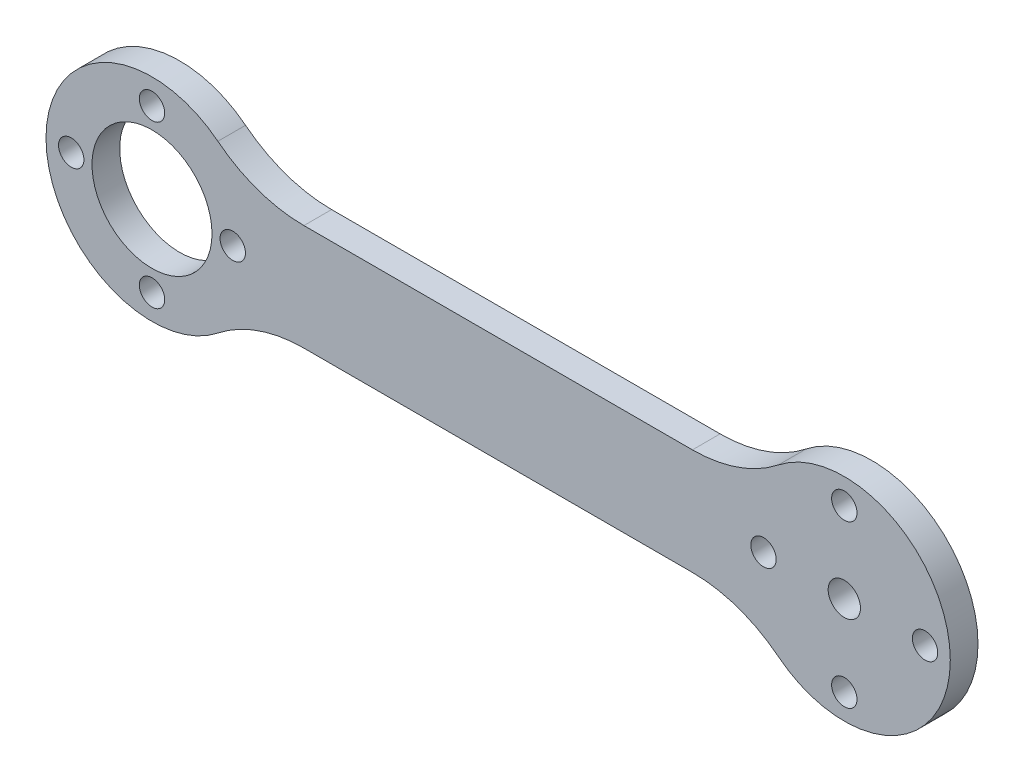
ISO-10303-21;
HEADER;
FILE_DESCRIPTION(('STEP AP214'),'2;1');
FILE_NAME('part.step','',(''),(''),'','','');
FILE_SCHEMA(('AUTOMOTIVE_DESIGN { 1 0 10303 214 1 1 1 1 }'));
ENDSEC;
DATA;
#1=APPLICATION_CONTEXT('core data for automotive mechanical design processes');
#2=APPLICATION_PROTOCOL_DEFINITION('international standard','automotive_design',2000,#1);
#3=PRODUCT_CONTEXT('',#1,'mechanical');
#4=PRODUCT('Part','Part','',(#3));
#5=PRODUCT_RELATED_PRODUCT_CATEGORY('part','',(#4));
#6=PRODUCT_DEFINITION_FORMATION('','',#4);
#7=PRODUCT_DEFINITION_CONTEXT('part definition',#1,'design');
#8=PRODUCT_DEFINITION('design','',#6,#7);
#9=PRODUCT_DEFINITION_SHAPE('','',#8);
#10=(LENGTH_UNIT() NAMED_UNIT(*) SI_UNIT(.MILLI.,.METRE.));
#11=(NAMED_UNIT(*) PLANE_ANGLE_UNIT() SI_UNIT($,.RADIAN.));
#12=(NAMED_UNIT(*) SI_UNIT($,.STERADIAN.) SOLID_ANGLE_UNIT());
#13=UNCERTAINTY_MEASURE_WITH_UNIT(LENGTH_MEASURE(1.E-05),#10,'distance_accuracy_value','');
#14=(GEOMETRIC_REPRESENTATION_CONTEXT(3) GLOBAL_UNCERTAINTY_ASSIGNED_CONTEXT((#13)) GLOBAL_UNIT_ASSIGNED_CONTEXT((#10,
#11,#12)) REPRESENTATION_CONTEXT('',''));
#15=CARTESIAN_POINT('',(0.,0.,0.));
#16=DIRECTION('',(0.,0.,1.));
#17=DIRECTION('',(1.,0.,0.));
#18=AXIS2_PLACEMENT_3D('',#15,#16,#17);
#19=CARTESIAN_POINT('',(75.,4.44089209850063E-13,6.));
#20=DIRECTION('',(0.,0.,-1.));
#21=DIRECTION('',(-1.,0.,0.));
#22=AXIS2_PLACEMENT_3D('',#19,#20,#21);
#23=PLANE('',#22);
#24=CARTESIAN_POINT('',(75.,4.44089209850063E-13,6.));
#25=DIRECTION('',(0.,0.,1.));
#26=DIRECTION('',(-1.,0.,0.));
#27=AXIS2_PLACEMENT_3D('',#24,#25,#26);
#28=CIRCLE('',#27,22.9664263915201);
#29=CARTESIAN_POINT('',(60.7292913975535,-17.9945440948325,6.));
#30=VERTEX_POINT('',#29);
#31=CARTESIAN_POINT('',(60.7292913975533,17.9945440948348,6.));
#32=VERTEX_POINT('',#31);
#33=EDGE_CURVE('E49',#30,#32,#28,.T.);
#34=ORIENTED_EDGE('',*,*,#33,.T.);
#35=CARTESIAN_POINT('',(42.0881127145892,41.5000000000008,6.));
#36=DIRECTION('',(0.,0.,-1.));
#37=DIRECTION('',(1.,0.,0.));
#38=AXIS2_PLACEMENT_3D('',#35,#36,#37);
#39=CIRCLE('',#38,30.);
#40=CARTESIAN_POINT('',(42.0881127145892,11.5000000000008,6.));
#41=VERTEX_POINT('',#40);
#42=EDGE_CURVE('E176',#32,#41,#39,.T.);
#43=ORIENTED_EDGE('',*,*,#42,.T.);
#44=DIRECTION('',(-1.,0.,0.));
#45=VECTOR('',#44,1.);
#46=CARTESIAN_POINT('',(-42.0881127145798,11.5000000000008,6.));
#47=LINE('',#46,#45);
#48=CARTESIAN_POINT('',(-42.0881127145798,11.5000000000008,6.));
#49=VERTEX_POINT('',#48);
#50=EDGE_CURVE('E159',#41,#49,#47,.T.);
#51=ORIENTED_EDGE('',*,*,#50,.T.);
#52=CARTESIAN_POINT('',(-42.0881127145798,41.5000000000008,6.));
#53=DIRECTION('',(0.,0.,-1.));
#54=DIRECTION('',(-1.,0.,0.));
#55=AXIS2_PLACEMENT_3D('',#52,#53,#54);
#56=CIRCLE('',#55,30.);
#57=CARTESIAN_POINT('',(-60.7292913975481,17.994544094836,6.));
#58=VERTEX_POINT('',#57);
#59=EDGE_CURVE('E172',#49,#58,#56,.T.);
#60=ORIENTED_EDGE('',*,*,#59,.T.);
#61=CARTESIAN_POINT('',(-75.,0.,6.));
#62=DIRECTION('',(0.,0.,1.));
#63=DIRECTION('',(1.,0.,0.));
#64=AXIS2_PLACEMENT_3D('',#61,#62,#63);
#65=CIRCLE('',#64,22.9664263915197);
#66=CARTESIAN_POINT('',(-60.7292913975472,-17.9945440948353,6.));
#67=VERTEX_POINT('',#66);
#68=EDGE_CURVE('E110',#58,#67,#65,.T.);
#69=ORIENTED_EDGE('',*,*,#68,.T.);
#70=CARTESIAN_POINT('',(-42.0881127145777,-41.4999999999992,6.));
#71=DIRECTION('',(0.,0.,-1.));
#72=DIRECTION('',(-1.,0.,0.));
#73=AXIS2_PLACEMENT_3D('',#70,#71,#72);
#74=CIRCLE('',#73,30.);
#75=CARTESIAN_POINT('',(-42.0881127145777,-11.4999999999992,6.));
#76=VERTEX_POINT('',#75);
#77=EDGE_CURVE('E104',#67,#76,#74,.T.);
#78=ORIENTED_EDGE('',*,*,#77,.T.);
#79=DIRECTION('',(1.,0.,0.));
#80=VECTOR('',#79,1.);
#81=CARTESIAN_POINT('',(-42.0881127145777,-11.4999999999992,6.));
#82=LINE('',#81,#80);
#83=CARTESIAN_POINT('',(42.0881127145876,-11.4999999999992,6.));
#84=VERTEX_POINT('',#83);
#85=EDGE_CURVE('E108',#76,#84,#82,.T.);
#86=ORIENTED_EDGE('',*,*,#85,.T.);
#87=CARTESIAN_POINT('',(42.0881127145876,-41.4999999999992,6.));
#88=DIRECTION('',(0.,0.,-1.));
#89=DIRECTION('',(-1.,0.,0.));
#90=AXIS2_PLACEMENT_3D('',#87,#88,#89);
#91=CIRCLE('',#90,30.);
#92=EDGE_CURVE('E124',#84,#30,#91,.T.);
#93=ORIENTED_EDGE('',*,*,#92,.T.);
#94=EDGE_LOOP('',(#34,#43,#51,#60,#69,#78,#86,#93));
#95=FACE_BOUND('',#94,.T.);
#96=CARTESIAN_POINT('',(-75.,0.,6.));
#97=DIRECTION('',(0.,0.,1.));
#98=DIRECTION('',(1.,0.,0.));
#99=AXIS2_PLACEMENT_3D('',#96,#97,#98);
#100=CIRCLE('',#99,13.);
#101=CARTESIAN_POINT('',(-62.,0.,6.));
#102=VERTEX_POINT('',#101);
#103=EDGE_CURVE('E133',#102,#102,#100,.T.);
#104=ORIENTED_EDGE('',*,*,#103,.F.);
#105=EDGE_LOOP('',(#104));
#106=FACE_BOUND('',#105,.T.);
#107=CARTESIAN_POINT('',(-75.,17.5,6.));
#108=DIRECTION('',(0.,0.,1.));
#109=DIRECTION('',(1.,0.,0.));
#110=AXIS2_PLACEMENT_3D('',#107,#108,#109);
#111=CIRCLE('',#110,2.75000000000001);
#112=CARTESIAN_POINT('',(-72.25,17.5,6.));
#113=VERTEX_POINT('',#112);
#114=EDGE_CURVE('E182',#113,#113,#111,.T.);
#115=ORIENTED_EDGE('',*,*,#114,.F.);
#116=EDGE_LOOP('',(#115));
#117=FACE_BOUND('',#116,.T.);
#118=CARTESIAN_POINT('',(57.4999999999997,6.38378239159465E-13,6.));
#119=DIRECTION('',(0.,0.,1.));
#120=DIRECTION('',(-1.,0.,0.));
#121=AXIS2_PLACEMENT_3D('',#118,#119,#120);
#122=CIRCLE('',#121,2.75000000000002);
#123=CARTESIAN_POINT('',(54.7499999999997,6.38378239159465E-13,6.));
#124=VERTEX_POINT('',#123);
#125=EDGE_CURVE('E188',#124,#124,#122,.T.);
#126=ORIENTED_EDGE('',*,*,#125,.F.);
#127=EDGE_LOOP('',(#126));
#128=FACE_BOUND('',#127,.T.);
#129=CARTESIAN_POINT('',(-57.4999999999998,1.94289029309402E-13,6.));
#130=DIRECTION('',(0.,0.,1.));
#131=DIRECTION('',(1.,0.,0.));
#132=AXIS2_PLACEMENT_3D('',#129,#130,#131);
#133=CIRCLE('',#132,2.75000000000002);
#134=CARTESIAN_POINT('',(-54.7499999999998,1.94289029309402E-13,6.));
#135=VERTEX_POINT('',#134);
#136=EDGE_CURVE('E194',#135,#135,#133,.T.);
#137=ORIENTED_EDGE('',*,*,#136,.F.);
#138=EDGE_LOOP('',(#137));
#139=FACE_BOUND('',#138,.T.);
#140=CARTESIAN_POINT('',(-74.9999999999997,-17.5,6.));
#141=DIRECTION('',(0.,0.,1.));
#142=DIRECTION('',(1.,0.,0.));
#143=AXIS2_PLACEMENT_3D('',#140,#141,#142);
#144=CIRCLE('',#143,2.75);
#145=CARTESIAN_POINT('',(-72.2499999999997,-17.5,6.));
#146=VERTEX_POINT('',#145);
#147=EDGE_CURVE('E200',#146,#146,#144,.T.);
#148=ORIENTED_EDGE('',*,*,#147,.F.);
#149=EDGE_LOOP('',(#148));
#150=FACE_BOUND('',#149,.T.);
#151=CARTESIAN_POINT('',(-92.4999999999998,0.,6.));
#152=DIRECTION('',(0.,0.,1.));
#153=DIRECTION('',(1.,0.,0.));
#154=AXIS2_PLACEMENT_3D('',#151,#152,#153);
#155=CIRCLE('',#154,2.75000000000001);
#156=CARTESIAN_POINT('',(-89.7499999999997,0.,6.));
#157=VERTEX_POINT('',#156);
#158=EDGE_CURVE('E206',#157,#157,#155,.T.);
#159=ORIENTED_EDGE('',*,*,#158,.F.);
#160=EDGE_LOOP('',(#159));
#161=FACE_BOUND('',#160,.T.);
#162=CARTESIAN_POINT('',(74.9999999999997,-17.4999999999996,6.));
#163=DIRECTION('',(0.,0.,1.));
#164=DIRECTION('',(-1.,0.,0.));
#165=AXIS2_PLACEMENT_3D('',#162,#163,#164);
#166=CIRCLE('',#165,2.75);
#167=CARTESIAN_POINT('',(72.2499999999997,-17.4999999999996,6.));
#168=VERTEX_POINT('',#167);
#169=EDGE_CURVE('E212',#168,#168,#166,.T.);
#170=ORIENTED_EDGE('',*,*,#169,.F.);
#171=EDGE_LOOP('',(#170));
#172=FACE_BOUND('',#171,.T.);
#173=CARTESIAN_POINT('',(92.4999999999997,5.96744875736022E-13,6.));
#174=DIRECTION('',(0.,0.,1.));
#175=DIRECTION('',(-1.,0.,0.));
#176=AXIS2_PLACEMENT_3D('',#173,#174,#175);
#177=CIRCLE('',#176,2.7499999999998);
#178=CARTESIAN_POINT('',(89.7499999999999,5.96744875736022E-13,6.));
#179=VERTEX_POINT('',#178);
#180=EDGE_CURVE('E218',#179,#179,#177,.T.);
#181=ORIENTED_EDGE('',*,*,#180,.F.);
#182=EDGE_LOOP('',(#181));
#183=FACE_BOUND('',#182,.T.);
#184=CARTESIAN_POINT('',(74.9999999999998,17.5000000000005,6.));
#185=DIRECTION('',(0.,0.,1.));
#186=DIRECTION('',(-1.,0.,0.));
#187=AXIS2_PLACEMENT_3D('',#184,#185,#186);
#188=CIRCLE('',#187,2.75000000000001);
#189=CARTESIAN_POINT('',(72.2499999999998,17.5000000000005,6.));
#190=VERTEX_POINT('',#189);
#191=EDGE_CURVE('E224',#190,#190,#188,.T.);
#192=ORIENTED_EDGE('',*,*,#191,.F.);
#193=EDGE_LOOP('',(#192));
#194=FACE_BOUND('',#193,.T.);
#195=CARTESIAN_POINT('',(75.,4.44089209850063E-13,6.));
#196=DIRECTION('',(0.,0.,1.));
#197=DIRECTION('',(1.,0.,0.));
#198=AXIS2_PLACEMENT_3D('',#195,#196,#197);
#199=CIRCLE('',#198,3.50000000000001);
#200=CARTESIAN_POINT('',(78.5,4.44089209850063E-13,6.));
#201=VERTEX_POINT('',#200);
#202=EDGE_CURVE('E230',#201,#201,#199,.T.);
#203=ORIENTED_EDGE('',*,*,#202,.F.);
#204=EDGE_LOOP('',(#203));
#205=FACE_BOUND('',#204,.T.);
#206=ADVANCED_FACE('F32',(#95,#106,#117,#128,#139,#150,#161,#172,#183,#194,#205),#23,.F.);
#207=CARTESIAN_POINT('',(75.,4.44089209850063E-13,0.));
#208=DIRECTION('',(0.,0.,-1.));
#209=DIRECTION('',(-1.,0.,0.));
#210=AXIS2_PLACEMENT_3D('',#207,#208,#209);
#211=PLANE('',#210);
#212=CARTESIAN_POINT('',(74.9999999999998,17.5000000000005,0.));
#213=DIRECTION('',(0.,0.,1.));
#214=DIRECTION('',(-1.,0.,0.));
#215=AXIS2_PLACEMENT_3D('',#212,#213,#214);
#216=CIRCLE('',#215,2.75000000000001);
#217=CARTESIAN_POINT('',(72.2499999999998,17.5000000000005,0.));
#218=VERTEX_POINT('',#217);
#219=EDGE_CURVE('E227',#218,#218,#216,.T.);
#220=ORIENTED_EDGE('',*,*,#219,.T.);
#221=EDGE_LOOP('',(#220));
#222=FACE_BOUND('',#221,.T.);
#223=CARTESIAN_POINT('',(74.9999999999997,-17.4999999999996,0.));
#224=DIRECTION('',(0.,0.,1.));
#225=DIRECTION('',(-1.,0.,0.));
#226=AXIS2_PLACEMENT_3D('',#223,#224,#225);
#227=CIRCLE('',#226,2.75);
#228=CARTESIAN_POINT('',(72.2499999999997,-17.4999999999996,0.));
#229=VERTEX_POINT('',#228);
#230=EDGE_CURVE('E215',#229,#229,#227,.T.);
#231=ORIENTED_EDGE('',*,*,#230,.T.);
#232=EDGE_LOOP('',(#231));
#233=FACE_BOUND('',#232,.T.);
#234=CARTESIAN_POINT('',(-74.9999999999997,-17.5,0.));
#235=DIRECTION('',(0.,0.,1.));
#236=DIRECTION('',(1.,0.,0.));
#237=AXIS2_PLACEMENT_3D('',#234,#235,#236);
#238=CIRCLE('',#237,2.75);
#239=CARTESIAN_POINT('',(-72.2499999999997,-17.5,0.));
#240=VERTEX_POINT('',#239);
#241=EDGE_CURVE('E203',#240,#240,#238,.T.);
#242=ORIENTED_EDGE('',*,*,#241,.T.);
#243=EDGE_LOOP('',(#242));
#244=FACE_BOUND('',#243,.T.);
#245=CARTESIAN_POINT('',(57.4999999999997,6.38378239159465E-13,0.));
#246=DIRECTION('',(0.,0.,1.));
#247=DIRECTION('',(-1.,0.,0.));
#248=AXIS2_PLACEMENT_3D('',#245,#246,#247);
#249=CIRCLE('',#248,2.75000000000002);
#250=CARTESIAN_POINT('',(54.7499999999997,6.38378239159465E-13,0.));
#251=VERTEX_POINT('',#250);
#252=EDGE_CURVE('E191',#251,#251,#249,.T.);
#253=ORIENTED_EDGE('',*,*,#252,.T.);
#254=EDGE_LOOP('',(#253));
#255=FACE_BOUND('',#254,.T.);
#256=CARTESIAN_POINT('',(-75.,0.,0.));
#257=DIRECTION('',(0.,0.,1.));
#258=DIRECTION('',(1.,0.,0.));
#259=AXIS2_PLACEMENT_3D('',#256,#257,#258);
#260=CIRCLE('',#259,13.);
#261=CARTESIAN_POINT('',(-62.,0.,0.));
#262=VERTEX_POINT('',#261);
#263=EDGE_CURVE('E179',#262,#262,#260,.T.);
#264=ORIENTED_EDGE('',*,*,#263,.T.);
#265=EDGE_LOOP('',(#264));
#266=FACE_BOUND('',#265,.T.);
#267=CARTESIAN_POINT('',(42.0881127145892,41.5000000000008,0.));
#268=DIRECTION('',(0.,0.,-1.));
#269=DIRECTION('',(1.,0.,0.));
#270=AXIS2_PLACEMENT_3D('',#267,#268,#269);
#271=CIRCLE('',#270,30.);
#272=CARTESIAN_POINT('',(60.7292913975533,17.9945440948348,0.));
#273=VERTEX_POINT('',#272);
#274=CARTESIAN_POINT('',(42.0881127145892,11.5000000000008,0.));
#275=VERTEX_POINT('',#274);
#276=EDGE_CURVE('E130',#273,#275,#271,.T.);
#277=ORIENTED_EDGE('',*,*,#276,.F.);
#278=CARTESIAN_POINT('',(75.,4.44089209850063E-13,0.));
#279=DIRECTION('',(0.,0.,1.));
#280=DIRECTION('',(-1.,0.,0.));
#281=AXIS2_PLACEMENT_3D('',#278,#279,#280);
#282=CIRCLE('',#281,22.9664263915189);
#283=CARTESIAN_POINT('',(60.7292913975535,-17.9945440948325,0.));
#284=VERTEX_POINT('',#283);
#285=EDGE_CURVE('E86',#284,#273,#282,.T.);
#286=ORIENTED_EDGE('',*,*,#285,.F.);
#287=CARTESIAN_POINT('',(42.0881127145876,-41.4999999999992,0.));
#288=DIRECTION('',(0.,0.,-1.));
#289=DIRECTION('',(-1.,0.,0.));
#290=AXIS2_PLACEMENT_3D('',#287,#288,#289);
#291=CIRCLE('',#290,30.);
#292=CARTESIAN_POINT('',(42.0881127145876,-11.4999999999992,0.));
#293=VERTEX_POINT('',#292);
#294=EDGE_CURVE('E141',#293,#284,#291,.T.);
#295=ORIENTED_EDGE('',*,*,#294,.F.);
#296=DIRECTION('',(1.,0.,0.));
#297=VECTOR('',#296,1.);
#298=CARTESIAN_POINT('',(-42.0881127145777,-11.4999999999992,0.));
#299=LINE('',#298,#297);
#300=CARTESIAN_POINT('',(-42.0881127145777,-11.4999999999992,0.));
#301=VERTEX_POINT('',#300);
#302=EDGE_CURVE('E79',#301,#293,#299,.T.);
#303=ORIENTED_EDGE('',*,*,#302,.F.);
#304=CARTESIAN_POINT('',(-42.0881127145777,-41.4999999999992,0.));
#305=DIRECTION('',(0.,0.,-1.));
#306=DIRECTION('',(-1.,0.,0.));
#307=AXIS2_PLACEMENT_3D('',#304,#305,#306);
#308=CIRCLE('',#307,30.);
#309=CARTESIAN_POINT('',(-60.7292913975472,-17.9945440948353,0.));
#310=VERTEX_POINT('',#309);
#311=EDGE_CURVE('E118',#310,#301,#308,.T.);
#312=ORIENTED_EDGE('',*,*,#311,.F.);
#313=CARTESIAN_POINT('',(-75.,0.,0.));
#314=DIRECTION('',(0.,0.,1.));
#315=DIRECTION('',(1.,0.,0.));
#316=AXIS2_PLACEMENT_3D('',#313,#314,#315);
#317=CIRCLE('',#316,22.9664263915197);
#318=CARTESIAN_POINT('',(-60.7292913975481,17.994544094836,0.));
#319=VERTEX_POINT('',#318);
#320=EDGE_CURVE('E137',#319,#310,#317,.T.);
#321=ORIENTED_EDGE('',*,*,#320,.F.);
#322=CARTESIAN_POINT('',(-42.0881127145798,41.5000000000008,0.));
#323=DIRECTION('',(0.,0.,-1.));
#324=DIRECTION('',(-1.,0.,0.));
#325=AXIS2_PLACEMENT_3D('',#322,#323,#324);
#326=CIRCLE('',#325,30.);
#327=CARTESIAN_POINT('',(-42.0881127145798,11.5000000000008,0.));
#328=VERTEX_POINT('',#327);
#329=EDGE_CURVE('E135',#328,#319,#326,.T.);
#330=ORIENTED_EDGE('',*,*,#329,.F.);
#331=DIRECTION('',(-1.,0.,0.));
#332=VECTOR('',#331,1.);
#333=CARTESIAN_POINT('',(-42.0881127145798,11.5000000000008,0.));
#334=LINE('',#333,#332);
#335=EDGE_CURVE('E132',#275,#328,#334,.T.);
#336=ORIENTED_EDGE('',*,*,#335,.F.);
#337=EDGE_LOOP('',(#277,#286,#295,#303,#312,#321,#330,#336));
#338=FACE_BOUND('',#337,.T.);
#339=CARTESIAN_POINT('',(-75.,17.5,0.));
#340=DIRECTION('',(0.,0.,1.));
#341=DIRECTION('',(1.,0.,0.));
#342=AXIS2_PLACEMENT_3D('',#339,#340,#341);
#343=CIRCLE('',#342,2.75000000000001);
#344=CARTESIAN_POINT('',(-72.25,17.5,0.));
#345=VERTEX_POINT('',#344);
#346=EDGE_CURVE('E185',#345,#345,#343,.T.);
#347=ORIENTED_EDGE('',*,*,#346,.T.);
#348=EDGE_LOOP('',(#347));
#349=FACE_BOUND('',#348,.T.);
#350=CARTESIAN_POINT('',(-57.4999999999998,1.94289029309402E-13,0.));
#351=DIRECTION('',(0.,0.,1.));
#352=DIRECTION('',(1.,0.,0.));
#353=AXIS2_PLACEMENT_3D('',#350,#351,#352);
#354=CIRCLE('',#353,2.75000000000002);
#355=CARTESIAN_POINT('',(-54.7499999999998,1.94289029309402E-13,0.));
#356=VERTEX_POINT('',#355);
#357=EDGE_CURVE('E197',#356,#356,#354,.T.);
#358=ORIENTED_EDGE('',*,*,#357,.T.);
#359=EDGE_LOOP('',(#358));
#360=FACE_BOUND('',#359,.T.);
#361=CARTESIAN_POINT('',(-92.4999999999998,0.,0.));
#362=DIRECTION('',(0.,0.,1.));
#363=DIRECTION('',(1.,0.,0.));
#364=AXIS2_PLACEMENT_3D('',#361,#362,#363);
#365=CIRCLE('',#364,2.75000000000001);
#366=CARTESIAN_POINT('',(-89.7499999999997,0.,0.));
#367=VERTEX_POINT('',#366);
#368=EDGE_CURVE('E209',#367,#367,#365,.T.);
#369=ORIENTED_EDGE('',*,*,#368,.T.);
#370=EDGE_LOOP('',(#369));
#371=FACE_BOUND('',#370,.T.);
#372=CARTESIAN_POINT('',(92.4999999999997,5.96744875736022E-13,0.));
#373=DIRECTION('',(0.,0.,1.));
#374=DIRECTION('',(-1.,0.,0.));
#375=AXIS2_PLACEMENT_3D('',#372,#373,#374);
#376=CIRCLE('',#375,2.7499999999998);
#377=CARTESIAN_POINT('',(89.7499999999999,5.96744875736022E-13,0.));
#378=VERTEX_POINT('',#377);
#379=EDGE_CURVE('E221',#378,#378,#376,.T.);
#380=ORIENTED_EDGE('',*,*,#379,.T.);
#381=EDGE_LOOP('',(#380));
#382=FACE_BOUND('',#381,.T.);
#383=CARTESIAN_POINT('',(75.,4.44089209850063E-13,0.));
#384=DIRECTION('',(0.,0.,1.));
#385=DIRECTION('',(1.,0.,0.));
#386=AXIS2_PLACEMENT_3D('',#383,#384,#385);
#387=CIRCLE('',#386,3.50000000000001);
#388=CARTESIAN_POINT('',(78.5,4.44089209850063E-13,0.));
#389=VERTEX_POINT('',#388);
#390=EDGE_CURVE('E233',#389,#389,#387,.T.);
#391=ORIENTED_EDGE('',*,*,#390,.T.);
#392=EDGE_LOOP('',(#391));
#393=FACE_BOUND('',#392,.T.);
#394=ADVANCED_FACE('F163',(#222,#233,#244,#255,#266,#338,#349,#360,#371,#382,#393),#211,.T.);
#395=CARTESIAN_POINT('',(42.0881127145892,41.5000000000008,6.));
#396=DIRECTION('',(0.,0.,-1.));
#397=DIRECTION('',(-1.,0.,0.));
#398=AXIS2_PLACEMENT_3D('',#395,#396,#397);
#399=CYLINDRICAL_SURFACE('',#398,30.);
#400=ORIENTED_EDGE('',*,*,#276,.T.);
#401=DIRECTION('',(0.,0.,-1.));
#402=VECTOR('',#401,1.);
#403=CARTESIAN_POINT('',(42.0881127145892,11.5000000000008,6.));
#404=LINE('',#403,#402);
#405=EDGE_CURVE('E41',#41,#275,#404,.T.);
#406=ORIENTED_EDGE('',*,*,#405,.F.);
#407=ORIENTED_EDGE('',*,*,#42,.F.);
#408=DIRECTION('',(0.,0.,-1.));
#409=VECTOR('',#408,1.);
#410=CARTESIAN_POINT('',(60.7292913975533,17.9945440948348,6.));
#411=LINE('',#410,#409);
#412=EDGE_CURVE('E11',#32,#273,#411,.T.);
#413=ORIENTED_EDGE('',*,*,#412,.T.);
#414=EDGE_LOOP('',(#400,#406,#407,#413));
#415=FACE_BOUND('',#414,.T.);
#416=ADVANCED_FACE('F34',(#415),#399,.F.);
#417=CARTESIAN_POINT('',(-42.0881127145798,11.5000000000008,6.));
#418=DIRECTION('',(0.,-1.,0.));
#419=DIRECTION('',(0.,0.,-1.));
#420=AXIS2_PLACEMENT_3D('',#417,#418,#419);
#421=PLANE('',#420);
#422=ORIENTED_EDGE('',*,*,#335,.T.);
#423=DIRECTION('',(0.,0.,-1.));
#424=VECTOR('',#423,1.);
#425=CARTESIAN_POINT('',(-42.0881127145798,11.5000000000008,6.));
#426=LINE('',#425,#424);
#427=EDGE_CURVE('E150',#49,#328,#426,.T.);
#428=ORIENTED_EDGE('',*,*,#427,.F.);
#429=ORIENTED_EDGE('',*,*,#50,.F.);
#430=ORIENTED_EDGE('',*,*,#405,.T.);
#431=EDGE_LOOP('',(#422,#428,#429,#430));
#432=FACE_BOUND('',#431,.T.);
#433=ADVANCED_FACE('F157',(#432),#421,.F.);
#434=CARTESIAN_POINT('',(-42.0881127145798,41.5000000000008,6.));
#435=DIRECTION('',(0.,0.,-1.));
#436=DIRECTION('',(-1.,0.,0.));
#437=AXIS2_PLACEMENT_3D('',#434,#435,#436);
#438=CYLINDRICAL_SURFACE('',#437,30.);
#439=ORIENTED_EDGE('',*,*,#329,.T.);
#440=DIRECTION('',(0.,0.,-1.));
#441=VECTOR('',#440,1.);
#442=CARTESIAN_POINT('',(-60.7292913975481,17.994544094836,6.));
#443=LINE('',#442,#441);
#444=EDGE_CURVE('E147',#58,#319,#443,.T.);
#445=ORIENTED_EDGE('',*,*,#444,.F.);
#446=ORIENTED_EDGE('',*,*,#59,.F.);
#447=ORIENTED_EDGE('',*,*,#427,.T.);
#448=EDGE_LOOP('',(#439,#445,#446,#447));
#449=FACE_BOUND('',#448,.T.);
#450=ADVANCED_FACE('F168',(#449),#438,.F.);
#451=CARTESIAN_POINT('',(-75.,0.,6.));
#452=DIRECTION('',(0.,0.,-1.));
#453=DIRECTION('',(-1.,0.,0.));
#454=AXIS2_PLACEMENT_3D('',#451,#452,#453);
#455=CYLINDRICAL_SURFACE('',#454,22.9664263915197);
#456=ORIENTED_EDGE('',*,*,#320,.T.);
#457=DIRECTION('',(0.,0.,-1.));
#458=VECTOR('',#457,1.);
#459=CARTESIAN_POINT('',(-60.7292913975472,-17.9945440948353,6.));
#460=LINE('',#459,#458);
#461=EDGE_CURVE('E119',#67,#310,#460,.T.);
#462=ORIENTED_EDGE('',*,*,#461,.F.);
#463=ORIENTED_EDGE('',*,*,#68,.F.);
#464=ORIENTED_EDGE('',*,*,#444,.T.);
#465=EDGE_LOOP('',(#456,#462,#463,#464));
#466=FACE_BOUND('',#465,.T.);
#467=ADVANCED_FACE('F171',(#466),#455,.T.);
#468=CARTESIAN_POINT('',(-42.0881127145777,-41.4999999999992,6.));
#469=DIRECTION('',(0.,0.,-1.));
#470=DIRECTION('',(-1.,0.,0.));
#471=AXIS2_PLACEMENT_3D('',#468,#469,#470);
#472=CYLINDRICAL_SURFACE('',#471,30.);
#473=ORIENTED_EDGE('',*,*,#311,.T.);
#474=DIRECTION('',(0.,0.,-1.));
#475=VECTOR('',#474,1.);
#476=CARTESIAN_POINT('',(-42.0881127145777,-11.4999999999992,6.));
#477=LINE('',#476,#475);
#478=EDGE_CURVE('E115',#76,#301,#477,.T.);
#479=ORIENTED_EDGE('',*,*,#478,.F.);
#480=ORIENTED_EDGE('',*,*,#77,.F.);
#481=ORIENTED_EDGE('',*,*,#461,.T.);
#482=EDGE_LOOP('',(#473,#479,#480,#481));
#483=FACE_BOUND('',#482,.T.);
#484=ADVANCED_FACE('F116',(#483),#472,.F.);
#485=CARTESIAN_POINT('',(-42.0881127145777,-11.4999999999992,6.));
#486=DIRECTION('',(0.,1.,0.));
#487=DIRECTION('',(0.,0.,1.));
#488=AXIS2_PLACEMENT_3D('',#485,#486,#487);
#489=PLANE('',#488);
#490=ORIENTED_EDGE('',*,*,#302,.T.);
#491=DIRECTION('',(0.,0.,-1.));
#492=VECTOR('',#491,1.);
#493=CARTESIAN_POINT('',(42.0881127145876,-11.4999999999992,6.));
#494=LINE('',#493,#492);
#495=EDGE_CURVE('E120',#84,#293,#494,.T.);
#496=ORIENTED_EDGE('',*,*,#495,.F.);
#497=ORIENTED_EDGE('',*,*,#85,.F.);
#498=ORIENTED_EDGE('',*,*,#478,.T.);
#499=EDGE_LOOP('',(#490,#496,#497,#498));
#500=FACE_BOUND('',#499,.T.);
#501=ADVANCED_FACE('F122',(#500),#489,.F.);
#502=CARTESIAN_POINT('',(42.0881127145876,-41.4999999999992,6.));
#503=DIRECTION('',(0.,0.,-1.));
#504=DIRECTION('',(-1.,0.,0.));
#505=AXIS2_PLACEMENT_3D('',#502,#503,#504);
#506=CYLINDRICAL_SURFACE('',#505,30.);
#507=ORIENTED_EDGE('',*,*,#294,.T.);
#508=DIRECTION('',(0.,0.,-1.));
#509=VECTOR('',#508,1.);
#510=CARTESIAN_POINT('',(60.7292913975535,-17.9945440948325,6.));
#511=LINE('',#510,#509);
#512=EDGE_CURVE('E126',#30,#284,#511,.T.);
#513=ORIENTED_EDGE('',*,*,#512,.F.);
#514=ORIENTED_EDGE('',*,*,#92,.F.);
#515=ORIENTED_EDGE('',*,*,#495,.T.);
#516=EDGE_LOOP('',(#507,#513,#514,#515));
#517=FACE_BOUND('',#516,.T.);
#518=ADVANCED_FACE('F256',(#517),#506,.F.);
#519=CARTESIAN_POINT('',(75.,4.44089209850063E-13,6.));
#520=DIRECTION('',(0.,0.,-1.));
#521=DIRECTION('',(-1.,0.,0.));
#522=AXIS2_PLACEMENT_3D('',#519,#520,#521);
#523=CYLINDRICAL_SURFACE('',#522,22.9664263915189);
#524=ORIENTED_EDGE('',*,*,#285,.T.);
#525=ORIENTED_EDGE('',*,*,#412,.F.);
#526=ORIENTED_EDGE('',*,*,#33,.F.);
#527=ORIENTED_EDGE('',*,*,#512,.T.);
#528=EDGE_LOOP('',(#524,#525,#526,#527));
#529=FACE_BOUND('',#528,.T.);
#530=ADVANCED_FACE('F253',(#529),#523,.T.);
#531=CARTESIAN_POINT('',(-75.,0.,6.));
#532=DIRECTION('',(0.,0.,-1.));
#533=DIRECTION('',(-1.,0.,0.));
#534=AXIS2_PLACEMENT_3D('',#531,#532,#533);
#535=CYLINDRICAL_SURFACE('',#534,13.);
#536=ORIENTED_EDGE('',*,*,#103,.T.);
#537=EDGE_LOOP('',(#536));
#538=FACE_BOUND('',#537,.T.);
#539=ORIENTED_EDGE('',*,*,#263,.F.);
#540=EDGE_LOOP('',(#539));
#541=FACE_BOUND('',#540,.T.);
#542=ADVANCED_FACE('F250',(#538,#541),#535,.F.);
#543=CARTESIAN_POINT('',(-75.,17.5,6.));
#544=DIRECTION('',(0.,0.,-1.));
#545=DIRECTION('',(-1.,0.,0.));
#546=AXIS2_PLACEMENT_3D('',#543,#544,#545);
#547=CYLINDRICAL_SURFACE('',#546,2.75000000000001);
#548=ORIENTED_EDGE('',*,*,#114,.T.);
#549=EDGE_LOOP('',(#548));
#550=FACE_BOUND('',#549,.T.);
#551=ORIENTED_EDGE('',*,*,#346,.F.);
#552=EDGE_LOOP('',(#551));
#553=FACE_BOUND('',#552,.T.);
#554=ADVANCED_FACE('F340',(#550,#553),#547,.F.);
#555=CARTESIAN_POINT('',(57.4999999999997,6.38378239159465E-13,6.));
#556=DIRECTION('',(0.,0.,-1.));
#557=DIRECTION('',(-1.,0.,0.));
#558=AXIS2_PLACEMENT_3D('',#555,#556,#557);
#559=CYLINDRICAL_SURFACE('',#558,2.75000000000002);
#560=ORIENTED_EDGE('',*,*,#125,.T.);
#561=EDGE_LOOP('',(#560));
#562=FACE_BOUND('',#561,.T.);
#563=ORIENTED_EDGE('',*,*,#252,.F.);
#564=EDGE_LOOP('',(#563));
#565=FACE_BOUND('',#564,.T.);
#566=ADVANCED_FACE('F348',(#562,#565),#559,.F.);
#567=CARTESIAN_POINT('',(-57.4999999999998,1.94289029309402E-13,6.));
#568=DIRECTION('',(0.,0.,-1.));
#569=DIRECTION('',(-1.,0.,0.));
#570=AXIS2_PLACEMENT_3D('',#567,#568,#569);
#571=CYLINDRICAL_SURFACE('',#570,2.75000000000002);
#572=ORIENTED_EDGE('',*,*,#136,.T.);
#573=EDGE_LOOP('',(#572));
#574=FACE_BOUND('',#573,.T.);
#575=ORIENTED_EDGE('',*,*,#357,.F.);
#576=EDGE_LOOP('',(#575));
#577=FACE_BOUND('',#576,.T.);
#578=ADVANCED_FACE('F356',(#574,#577),#571,.F.);
#579=CARTESIAN_POINT('',(-74.9999999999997,-17.5,6.));
#580=DIRECTION('',(0.,0.,-1.));
#581=DIRECTION('',(-1.,0.,0.));
#582=AXIS2_PLACEMENT_3D('',#579,#580,#581);
#583=CYLINDRICAL_SURFACE('',#582,2.75);
#584=ORIENTED_EDGE('',*,*,#147,.T.);
#585=EDGE_LOOP('',(#584));
#586=FACE_BOUND('',#585,.T.);
#587=ORIENTED_EDGE('',*,*,#241,.F.);
#588=EDGE_LOOP('',(#587));
#589=FACE_BOUND('',#588,.T.);
#590=ADVANCED_FACE('F365',(#586,#589),#583,.F.);
#591=CARTESIAN_POINT('',(-92.4999999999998,0.,6.));
#592=DIRECTION('',(0.,0.,-1.));
#593=DIRECTION('',(-1.,0.,0.));
#594=AXIS2_PLACEMENT_3D('',#591,#592,#593);
#595=CYLINDRICAL_SURFACE('',#594,2.75000000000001);
#596=ORIENTED_EDGE('',*,*,#158,.T.);
#597=EDGE_LOOP('',(#596));
#598=FACE_BOUND('',#597,.T.);
#599=ORIENTED_EDGE('',*,*,#368,.F.);
#600=EDGE_LOOP('',(#599));
#601=FACE_BOUND('',#600,.T.);
#602=ADVANCED_FACE('F374',(#598,#601),#595,.F.);
#603=CARTESIAN_POINT('',(74.9999999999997,-17.4999999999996,6.));
#604=DIRECTION('',(0.,0.,-1.));
#605=DIRECTION('',(-1.,0.,0.));
#606=AXIS2_PLACEMENT_3D('',#603,#604,#605);
#607=CYLINDRICAL_SURFACE('',#606,2.75);
#608=ORIENTED_EDGE('',*,*,#169,.T.);
#609=EDGE_LOOP('',(#608));
#610=FACE_BOUND('',#609,.T.);
#611=ORIENTED_EDGE('',*,*,#230,.F.);
#612=EDGE_LOOP('',(#611));
#613=FACE_BOUND('',#612,.T.);
#614=ADVANCED_FACE('F383',(#610,#613),#607,.F.);
#615=CARTESIAN_POINT('',(92.4999999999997,5.96744875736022E-13,6.));
#616=DIRECTION('',(0.,0.,-1.));
#617=DIRECTION('',(-1.,0.,0.));
#618=AXIS2_PLACEMENT_3D('',#615,#616,#617);
#619=CYLINDRICAL_SURFACE('',#618,2.7499999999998);
#620=ORIENTED_EDGE('',*,*,#180,.T.);
#621=EDGE_LOOP('',(#620));
#622=FACE_BOUND('',#621,.T.);
#623=ORIENTED_EDGE('',*,*,#379,.F.);
#624=EDGE_LOOP('',(#623));
#625=FACE_BOUND('',#624,.T.);
#626=ADVANCED_FACE('F392',(#622,#625),#619,.F.);
#627=CARTESIAN_POINT('',(74.9999999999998,17.5000000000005,6.));
#628=DIRECTION('',(0.,0.,-1.));
#629=DIRECTION('',(-1.,0.,0.));
#630=AXIS2_PLACEMENT_3D('',#627,#628,#629);
#631=CYLINDRICAL_SURFACE('',#630,2.75000000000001);
#632=ORIENTED_EDGE('',*,*,#191,.T.);
#633=EDGE_LOOP('',(#632));
#634=FACE_BOUND('',#633,.T.);
#635=ORIENTED_EDGE('',*,*,#219,.F.);
#636=EDGE_LOOP('',(#635));
#637=FACE_BOUND('',#636,.T.);
#638=ADVANCED_FACE('F401',(#634,#637),#631,.F.);
#639=CARTESIAN_POINT('',(75.,4.44089209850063E-13,6.));
#640=DIRECTION('',(0.,0.,-1.));
#641=DIRECTION('',(-1.,0.,0.));
#642=AXIS2_PLACEMENT_3D('',#639,#640,#641);
#643=CYLINDRICAL_SURFACE('',#642,3.50000000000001);
#644=ORIENTED_EDGE('',*,*,#202,.T.);
#645=EDGE_LOOP('',(#644));
#646=FACE_BOUND('',#645,.T.);
#647=ORIENTED_EDGE('',*,*,#390,.F.);
#648=EDGE_LOOP('',(#647));
#649=FACE_BOUND('',#648,.T.);
#650=ADVANCED_FACE('F239',(#646,#649),#643,.F.);
#651=CLOSED_SHELL('',(#206,#394,#416,#433,#450,#467,#484,#501,#518,#530,#542,#554,#566,#578,
#590,#602,#614,#626,#638,#650));
#652=MANIFOLD_SOLID_BREP('B2',#651);
#653=ADVANCED_BREP_SHAPE_REPRESENTATION('',(#18,#652),#14);
#654=SHAPE_DEFINITION_REPRESENTATION(#9,#653);
ENDSEC;
END-ISO-10303-21;
